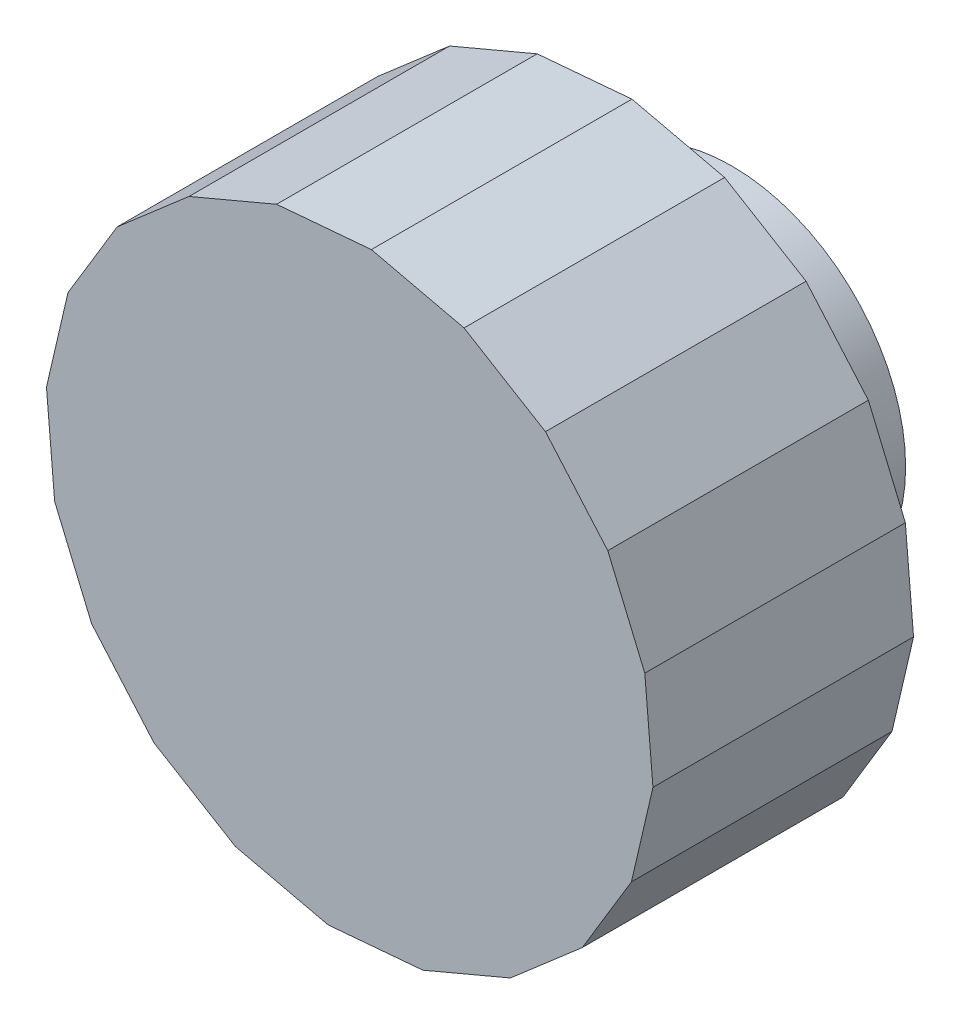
ISO-10303-21;
HEADER;
FILE_DESCRIPTION(('STEP AP214'),'2;1');
FILE_NAME('part.step','',(''),(''),'','','');
FILE_SCHEMA(('AUTOMOTIVE_DESIGN { 1 0 10303 214 1 1 1 1 }'));
ENDSEC;
DATA;
#1=APPLICATION_CONTEXT('core data for automotive mechanical design processes');
#2=APPLICATION_PROTOCOL_DEFINITION('international standard','automotive_design',2000,#1);
#3=PRODUCT_CONTEXT('',#1,'mechanical');
#4=PRODUCT('Part','Part','',(#3));
#5=PRODUCT_RELATED_PRODUCT_CATEGORY('part','',(#4));
#6=PRODUCT_DEFINITION_FORMATION('','',#4);
#7=PRODUCT_DEFINITION_CONTEXT('part definition',#1,'design');
#8=PRODUCT_DEFINITION('design','',#6,#7);
#9=PRODUCT_DEFINITION_SHAPE('','',#8);
#10=(LENGTH_UNIT() NAMED_UNIT(*) SI_UNIT(.MILLI.,.METRE.));
#11=(NAMED_UNIT(*) PLANE_ANGLE_UNIT() SI_UNIT($,.RADIAN.));
#12=(NAMED_UNIT(*) SI_UNIT($,.STERADIAN.) SOLID_ANGLE_UNIT());
#13=UNCERTAINTY_MEASURE_WITH_UNIT(LENGTH_MEASURE(1.E-05),#10,'distance_accuracy_value','');
#14=(GEOMETRIC_REPRESENTATION_CONTEXT(3) GLOBAL_UNCERTAINTY_ASSIGNED_CONTEXT((#13)) GLOBAL_UNIT_ASSIGNED_CONTEXT((#10,
#11,#12)) REPRESENTATION_CONTEXT('',''));
#15=CARTESIAN_POINT('',(0.,0.,0.));
#16=DIRECTION('',(0.,0.,1.));
#17=DIRECTION('',(1.,0.,0.));
#18=AXIS2_PLACEMENT_3D('',#15,#16,#17);
#19=CARTESIAN_POINT('',(0.,0.,7.));
#20=DIRECTION('',(0.,0.,-1.));
#21=DIRECTION('',(-1.,0.,0.));
#22=AXIS2_PLACEMENT_3D('',#19,#20,#21);
#23=CYLINDRICAL_SURFACE('',#22,10.);
#24=CARTESIAN_POINT('',(0.,10.,2.));
#25=CARTESIAN_POINT('',(0.083751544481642,9.99999865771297,2.00000345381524));
#26=CARTESIAN_POINT('',(0.167551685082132,9.9989368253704,2.00703800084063));
#27=CARTESIAN_POINT('',(0.332809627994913,9.99480315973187,2.03498319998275));
#28=CARTESIAN_POINT('',(0.414265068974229,9.99172936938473,2.05590736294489));
#29=CARTESIAN_POINT('',(0.57241808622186,9.98391721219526,2.11099250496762));
#30=CARTESIAN_POINT('',(0.649119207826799,9.97918010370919,2.14514347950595));
#31=CARTESIAN_POINT('',(0.795690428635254,9.96856475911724,2.22568837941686));
#32=CARTESIAN_POINT('',(0.865561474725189,9.96268668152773,2.27208060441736));
#33=CARTESIAN_POINT('',(0.997046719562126,9.95039170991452,2.37617726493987));
#34=CARTESIAN_POINT('',(1.0585998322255,9.94397133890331,2.43395845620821));
#35=CARTESIAN_POINT('',(1.17117490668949,9.93134261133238,2.55902768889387));
#36=CARTESIAN_POINT('',(1.22219626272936,9.92513426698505,2.62631627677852));
#37=CARTESIAN_POINT('',(1.31249729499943,9.91359877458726,2.76890064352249));
#38=CARTESIAN_POINT('',(1.35171787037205,9.90827611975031,2.84423424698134));
#39=CARTESIAN_POINT('',(1.41692632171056,9.89916211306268,3.00051282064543));
#40=CARTESIAN_POINT('',(1.44291491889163,9.89537067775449,3.08145748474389));
#41=CARTESIAN_POINT('',(1.48073198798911,9.88978256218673,3.24601804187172));
#42=CARTESIAN_POINT('',(1.49266503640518,9.8879711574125,3.32960939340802));
#43=CARTESIAN_POINT('',(1.50235624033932,9.88650348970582,3.49762616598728));
#44=CARTESIAN_POINT('',(1.50011520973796,9.88684710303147,3.58205153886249));
#45=CARTESIAN_POINT('',(1.48160733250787,9.88963718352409,3.74860108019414));
#46=CARTESIAN_POINT('',(1.4654569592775,9.89206618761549,3.8307385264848));
#47=CARTESIAN_POINT('',(1.41977117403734,9.89872608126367,3.99112436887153));
#48=CARTESIAN_POINT('',(1.39023538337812,9.90295702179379,4.06937265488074));
#49=CARTESIAN_POINT('',(1.31849603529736,9.91276335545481,4.22011337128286));
#50=CARTESIAN_POINT('',(1.27624314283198,9.91834396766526,4.29258196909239));
#51=CARTESIAN_POINT('',(1.18030413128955,9.93021707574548,4.42944459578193));
#52=CARTESIAN_POINT('',(1.12661726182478,9.93650961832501,4.49383809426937));
#53=CARTESIAN_POINT('',(1.00869493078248,9.94917473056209,4.61339766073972));
#54=CARTESIAN_POINT('',(0.944359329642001,9.95554747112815,4.66846499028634));
#55=CARTESIAN_POINT('',(0.807307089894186,9.96759647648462,4.76703593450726));
#56=CARTESIAN_POINT('',(0.73459041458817,9.9732727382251,4.8105394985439));
#57=CARTESIAN_POINT('',(0.582754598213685,9.98329515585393,4.88475308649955));
#58=CARTESIAN_POINT('',(0.50363167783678,9.98764051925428,4.9154554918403));
#59=CARTESIAN_POINT('',(0.34127318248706,9.99450490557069,4.96310938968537));
#60=CARTESIAN_POINT('',(0.2580378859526,9.99702405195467,4.98006181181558));
#61=CARTESIAN_POINT('',(0.0906695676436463,9.99993581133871,4.99960322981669));
#62=CARTESIAN_POINT('',(0.00655273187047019,10.0003485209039,5.00232797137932));
#63=CARTESIAN_POINT('',(-0.160936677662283,9.99905561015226,4.99369699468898));
#64=CARTESIAN_POINT('',(-0.244309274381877,9.99735005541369,4.9823417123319));
#65=CARTESIAN_POINT('',(-0.407532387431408,9.99202468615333,4.94598589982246));
#66=CARTESIAN_POINT('',(-0.487397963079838,9.98841415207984,4.92105150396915));
#67=CARTESIAN_POINT('',(-0.641814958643,9.97968235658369,4.85831500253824));
#68=CARTESIAN_POINT('',(-0.7163661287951,9.97456102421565,4.82051229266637));
#69=CARTESIAN_POINT('',(-0.858634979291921,9.96332682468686,4.73279377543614));
#70=CARTESIAN_POINT('',(-0.926299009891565,9.95720701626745,4.68279185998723));
#71=CARTESIAN_POINT('',(-1.05232367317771,9.94467863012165,4.57221418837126));
#72=CARTESIAN_POINT('',(-1.1106837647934,9.93827003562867,4.51163781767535));
#73=CARTESIAN_POINT('',(-1.21693784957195,9.92582264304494,4.38102646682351));
#74=CARTESIAN_POINT('',(-1.26474084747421,9.91978736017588,4.31091707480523));
#75=CARTESIAN_POINT('',(-1.34789129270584,9.90883219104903,4.16358395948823));
#76=CARTESIAN_POINT('',(-1.38323907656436,9.90391227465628,4.08636042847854));
#77=CARTESIAN_POINT('',(-1.44033467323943,9.89577033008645,3.92726246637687));
#78=CARTESIAN_POINT('',(-1.46213037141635,9.89254233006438,3.84540553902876));
#79=CARTESIAN_POINT('',(-1.49165549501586,9.88813382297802,3.67914098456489));
#80=CARTESIAN_POINT('',(-1.49938589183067,9.88695317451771,3.59473353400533));
#81=CARTESIAN_POINT('',(-1.5005378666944,9.88677832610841,3.42667093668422));
#82=CARTESIAN_POINT('',(-1.49410252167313,9.88776226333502,3.34301675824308));
#83=CARTESIAN_POINT('',(-1.46741229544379,9.89175820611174,3.17799473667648));
#84=CARTESIAN_POINT('',(-1.44715743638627,9.89477020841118,3.09662688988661));
#85=CARTESIAN_POINT('',(-1.39345373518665,9.90247526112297,2.93852691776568));
#86=CARTESIAN_POINT('',(-1.36001489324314,9.90716703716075,2.86179132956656));
#87=CARTESIAN_POINT('',(-1.28090667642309,9.91770454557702,2.7149963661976));
#88=CARTESIAN_POINT('',(-1.23523688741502,9.92355031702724,2.64493721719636));
#89=CARTESIAN_POINT('',(-1.13244337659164,9.93580743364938,2.51275694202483));
#90=CARTESIAN_POINT('',(-1.07521369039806,9.94222367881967,2.45071866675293));
#91=CARTESIAN_POINT('',(-0.951148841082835,9.95485788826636,2.33707544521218));
#92=CARTESIAN_POINT('',(-0.884311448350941,9.96107580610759,2.28547292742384));
#93=CARTESIAN_POINT('',(-0.742495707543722,9.9726518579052,2.19391232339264));
#94=CARTESIAN_POINT('',(-0.667474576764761,9.9780050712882,2.15401989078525));
#95=CARTESIAN_POINT('',(-0.511751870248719,9.98720028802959,2.08746148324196));
#96=CARTESIAN_POINT('',(-0.431056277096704,9.99104385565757,2.06078180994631));
#97=CARTESIAN_POINT('',(-0.291665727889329,9.99590939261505,2.02745865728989));
#98=CARTESIAN_POINT('',(-0.233831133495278,9.99743549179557,2.01717739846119));
#99=CARTESIAN_POINT('',(-0.117338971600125,9.99948125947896,2.00344690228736));
#100=CARTESIAN_POINT('',(-0.0586814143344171,10.0000009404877,1.99999758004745));
#101=CARTESIAN_POINT('',(0.,10.,2.));
#102=B_SPLINE_CURVE_WITH_KNOTS('',3,(#24,#25,#26,#27,#28,#29,#30,#31,#32,#33,#34,#35,#36,#37,
#38,#39,#40,#41,#42,#43,#44,#45,#46,#47,#48,#49,#50,#51,#52,#53,#54,#55,#56,#57,#58,#59,#60,#61,
#62,#63,#64,#65,#66,#67,#68,#69,#70,#71,#72,#73,#74,#75,#76,#77,#78,#79,#80,#81,#82,#83,#84,#85,
#86,#87,#88,#89,#90,#91,#92,#93,#94,#95,#96,#97,#98,#99,#100,#101),.UNSPECIFIED.,.T.,.F.,(4,2,2,
2,2,2,2,2,2,2,2,2,2,2,2,2,2,2,2,2,2,2,2,2,2,2,2,2,2,2,2,2,2,2,2,2,2,2,4),(0.,0.251040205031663,
0.50232496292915,0.753420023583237,1.0044802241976,1.25729416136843,1.5101226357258,
1.76419702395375,2.01825756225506,2.27041564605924,2.52255925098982,2.77261177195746,
3.02267136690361,3.27371383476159,3.52477278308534,3.77834291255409,4.03191415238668,
4.28563608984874,4.53934087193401,4.79062058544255,5.04189251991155,5.29195148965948,
5.54202220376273,5.79391188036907,6.0458162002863,6.29981366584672,6.55380426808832,
6.80689223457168,7.05996272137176,7.31048888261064,7.56101464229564,7.81135073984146,
8.06169531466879,8.3144482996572,8.56726003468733,8.82146323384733,9.07540233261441,
9.25129851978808,9.42719252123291),.UNSPECIFIED.);
#103=CARTESIAN_POINT('',(0.,10.,2.));
#104=VERTEX_POINT('',#103);
#105=EDGE_CURVE('E429',#104,#104,#102,.T.);
#106=ORIENTED_EDGE('',*,*,#105,.T.);
#107=EDGE_LOOP('',(#106));
#108=FACE_BOUND('',#107,.T.);
#109=CARTESIAN_POINT('',(0.,0.,7.));
#110=DIRECTION('',(0.,0.,1.));
#111=DIRECTION('',(1.,0.,0.));
#112=AXIS2_PLACEMENT_3D('',#109,#110,#111);
#113=CIRCLE('',#112,10.);
#114=CARTESIAN_POINT('',(10.,0.,7.));
#115=VERTEX_POINT('',#114);
#116=EDGE_CURVE('E11',#115,#115,#113,.T.);
#117=ORIENTED_EDGE('',*,*,#116,.F.);
#118=EDGE_LOOP('',(#117));
#119=FACE_BOUND('',#118,.T.);
#120=CARTESIAN_POINT('',(0.,0.,0.));
#121=DIRECTION('',(0.,0.,1.));
#122=DIRECTION('',(1.,0.,0.));
#123=AXIS2_PLACEMENT_3D('',#120,#121,#122);
#124=CIRCLE('',#123,10.);
#125=CARTESIAN_POINT('',(10.,0.,0.));
#126=VERTEX_POINT('',#125);
#127=EDGE_CURVE('E52',#126,#126,#124,.T.);
#128=ORIENTED_EDGE('',*,*,#127,.T.);
#129=EDGE_LOOP('',(#128));
#130=FACE_BOUND('',#129,.T.);
#131=ADVANCED_FACE('F43',(#108,#119,#130),#23,.T.);
#132=CARTESIAN_POINT('',(0.,0.,0.));
#133=DIRECTION('',(0.,0.,1.));
#134=DIRECTION('',(1.,0.,0.));
#135=AXIS2_PLACEMENT_3D('',#132,#133,#134);
#136=PLANE('',#135);
#137=DIRECTION('',(0.,1.,0.));
#138=VECTOR('',#137,1.);
#139=CARTESIAN_POINT('',(-2.75,0.,0.));
#140=LINE('',#139,#138);
#141=CARTESIAN_POINT('',(-2.75,5.5,0.));
#142=VERTEX_POINT('',#141);
#143=CARTESIAN_POINT('',(-2.75,8.5,0.));
#144=VERTEX_POINT('',#143);
#145=EDGE_CURVE('E486',#142,#144,#140,.T.);
#146=ORIENTED_EDGE('',*,*,#145,.F.);
#147=DIRECTION('',(-1.,0.,0.));
#148=VECTOR('',#147,1.);
#149=CARTESIAN_POINT('',(0.,5.5,0.));
#150=LINE('',#149,#148);
#151=CARTESIAN_POINT('',(2.75,5.5,0.));
#152=VERTEX_POINT('',#151);
#153=EDGE_CURVE('E60',#152,#142,#150,.T.);
#154=ORIENTED_EDGE('',*,*,#153,.F.);
#155=DIRECTION('',(0.,1.,0.));
#156=VECTOR('',#155,1.);
#157=CARTESIAN_POINT('',(2.75,0.,0.));
#158=LINE('',#157,#156);
#159=CARTESIAN_POINT('',(2.75,8.5,0.));
#160=VERTEX_POINT('',#159);
#161=EDGE_CURVE('E485',#152,#160,#158,.T.);
#162=ORIENTED_EDGE('',*,*,#161,.T.);
#163=DIRECTION('',(-1.,0.,0.));
#164=VECTOR('',#163,1.);
#165=CARTESIAN_POINT('',(0.,8.5,0.));
#166=LINE('',#165,#164);
#167=EDGE_CURVE('E474',#160,#144,#166,.T.);
#168=ORIENTED_EDGE('',*,*,#167,.T.);
#169=EDGE_LOOP('',(#146,#154,#162,#168));
#170=FACE_BOUND('',#169,.T.);
#171=CARTESIAN_POINT('',(0.,0.,0.));
#172=DIRECTION('',(0.,0.,-1.));
#173=DIRECTION('',(-1.,0.,0.));
#174=AXIS2_PLACEMENT_3D('',#171,#172,#173);
#175=CIRCLE('',#174,4.);
#176=CARTESIAN_POINT('',(-4.,0.,0.));
#177=VERTEX_POINT('',#176);
#178=EDGE_CURVE('E498',#177,#177,#175,.T.);
#179=ORIENTED_EDGE('',*,*,#178,.F.);
#180=EDGE_LOOP('',(#179));
#181=FACE_BOUND('',#180,.T.);
#182=ORIENTED_EDGE('',*,*,#127,.F.);
#183=EDGE_LOOP('',(#182));
#184=FACE_BOUND('',#183,.T.);
#185=ADVANCED_FACE('F321',(#170,#181,#184),#136,.F.);
#186=CARTESIAN_POINT('',(11.2687299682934,13.3890150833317,22.));
#187=DIRECTION('',(-0.516313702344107,-0.856399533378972,0.));
#188=DIRECTION('',(0.856399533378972,-0.516313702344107,0.));
#189=AXIS2_PLACEMENT_3D('',#186,#187,#188);
#190=PLANE('',#189);
#191=DIRECTION('',(-0.856399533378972,0.516313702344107,0.));
#192=VECTOR('',#191,1.);
#193=CARTESIAN_POINT('',(11.2687299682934,13.3890150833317,7.));
#194=LINE('',#193,#192);
#195=CARTESIAN_POINT('',(11.2687299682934,13.3890150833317,7.));
#196=VERTEX_POINT('',#195);
#197=CARTESIAN_POINT('',(6.57976586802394,16.2159391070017,7.));
#198=VERTEX_POINT('',#197);
#199=EDGE_CURVE('E227',#196,#198,#194,.T.);
#200=ORIENTED_EDGE('',*,*,#199,.T.);
#201=DIRECTION('',(0.,0.,-1.));
#202=VECTOR('',#201,1.);
#203=CARTESIAN_POINT('',(6.57976586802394,16.2159391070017,22.));
#204=LINE('',#203,#202);
#205=CARTESIAN_POINT('',(6.57976586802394,16.2159391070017,22.));
#206=VERTEX_POINT('',#205);
#207=EDGE_CURVE('E316',#206,#198,#204,.T.);
#208=ORIENTED_EDGE('',*,*,#207,.F.);
#209=DIRECTION('',(-0.856399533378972,0.516313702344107,0.));
#210=VECTOR('',#209,1.);
#211=CARTESIAN_POINT('',(11.2687299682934,13.3890150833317,22.));
#212=LINE('',#211,#210);
#213=CARTESIAN_POINT('',(11.2687299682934,13.3890150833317,22.));
#214=VERTEX_POINT('',#213);
#215=EDGE_CURVE('E267',#214,#206,#212,.T.);
#216=ORIENTED_EDGE('',*,*,#215,.F.);
#217=DIRECTION('',(0.,0.,-1.));
#218=VECTOR('',#217,1.);
#219=CARTESIAN_POINT('',(11.2687299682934,13.3890150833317,22.));
#220=LINE('',#219,#218);
#221=EDGE_CURVE('E223',#214,#196,#220,.T.);
#222=ORIENTED_EDGE('',*,*,#221,.T.);
#223=EDGE_LOOP('',(#200,#208,#216,#222));
#224=FACE_BOUND('',#223,.T.);
#225=ADVANCED_FACE('F323',(#224),#190,.F.);
#226=CARTESIAN_POINT('',(6.57976586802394,16.2159391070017,22.));
#227=DIRECTION('',(-0.226401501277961,-0.974034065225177,0.));
#228=DIRECTION('',(0.974034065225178,-0.226401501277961,0.));
#229=AXIS2_PLACEMENT_3D('',#226,#227,#228);
#230=PLANE('',#229);
#231=DIRECTION('',(-0.974034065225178,0.226401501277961,0.));
#232=VECTOR('',#231,1.);
#233=CARTESIAN_POINT('',(6.57976586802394,16.2159391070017,7.));
#234=LINE('',#233,#232);
#235=CARTESIAN_POINT('',(1.24672844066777,17.455534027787,7.));
#236=VERTEX_POINT('',#235);
#237=EDGE_CURVE('E230',#198,#236,#234,.T.);
#238=ORIENTED_EDGE('',*,*,#237,.T.);
#239=DIRECTION('',(0.,0.,-1.));
#240=VECTOR('',#239,1.);
#241=CARTESIAN_POINT('',(1.24672844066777,17.455534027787,22.));
#242=LINE('',#241,#240);
#243=CARTESIAN_POINT('',(1.24672844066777,17.455534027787,22.));
#244=VERTEX_POINT('',#243);
#245=EDGE_CURVE('E313',#244,#236,#242,.T.);
#246=ORIENTED_EDGE('',*,*,#245,.F.);
#247=DIRECTION('',(-0.974034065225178,0.226401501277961,0.));
#248=VECTOR('',#247,1.);
#249=CARTESIAN_POINT('',(6.57976586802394,16.2159391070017,22.));
#250=LINE('',#249,#248);
#251=EDGE_CURVE('E147',#206,#244,#250,.T.);
#252=ORIENTED_EDGE('',*,*,#251,.F.);
#253=ORIENTED_EDGE('',*,*,#207,.T.);
#254=EDGE_LOOP('',(#238,#246,#252,#253));
#255=FACE_BOUND('',#254,.T.);
#256=ADVANCED_FACE('F330',(#255),#230,.F.);
#257=CARTESIAN_POINT('',(1.24672844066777,17.455534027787,22.));
#258=DIRECTION('',(0.0856724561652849,-0.996323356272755,0.));
#259=DIRECTION('',(0.996323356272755,0.0856724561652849,0.));
#260=AXIS2_PLACEMENT_3D('',#257,#258,#259);
#261=PLANE('',#260);
#262=DIRECTION('',(-0.996323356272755,-0.0856724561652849,0.));
#263=VECTOR('',#262,1.);
#264=CARTESIAN_POINT('',(1.24672844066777,17.455534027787,7.));
#265=LINE('',#264,#263);
#266=CARTESIAN_POINT('',(-4.20834745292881,16.9864596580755,7.));
#267=VERTEX_POINT('',#266);
#268=EDGE_CURVE('E233',#236,#267,#265,.T.);
#269=ORIENTED_EDGE('',*,*,#268,.T.);
#270=DIRECTION('',(0.,0.,-1.));
#271=VECTOR('',#270,1.);
#272=CARTESIAN_POINT('',(-4.20834745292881,16.9864596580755,22.));
#273=LINE('',#272,#271);
#274=CARTESIAN_POINT('',(-4.20834745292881,16.9864596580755,22.));
#275=VERTEX_POINT('',#274);
#276=EDGE_CURVE('E310',#275,#267,#273,.T.);
#277=ORIENTED_EDGE('',*,*,#276,.F.);
#278=DIRECTION('',(-0.996323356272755,-0.0856724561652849,0.));
#279=VECTOR('',#278,1.);
#280=CARTESIAN_POINT('',(1.24672844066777,17.455534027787,22.));
#281=LINE('',#280,#279);
#282=EDGE_CURVE('E510',#244,#275,#281,.T.);
#283=ORIENTED_EDGE('',*,*,#282,.F.);
#284=ORIENTED_EDGE('',*,*,#245,.T.);
#285=EDGE_LOOP('',(#269,#277,#283,#284));
#286=FACE_BOUND('',#285,.T.);
#287=ADVANCED_FACE('F340',(#286),#261,.F.);
#288=CARTESIAN_POINT('',(-4.20834745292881,16.9864596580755,22.));
#289=DIRECTION('',(0.389360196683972,-0.921085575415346,0.));
#290=DIRECTION('',(0.921085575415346,0.389360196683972,0.));
#291=AXIS2_PLACEMENT_3D('',#288,#289,#290);
#292=PLANE('',#291);
#293=DIRECTION('',(-0.921085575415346,-0.389360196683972,0.));
#294=VECTOR('',#293,1.);
#295=CARTESIAN_POINT('',(-4.20834745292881,16.9864596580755,7.));
#296=LINE('',#295,#294);
#297=CARTESIAN_POINT('',(-9.25148097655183,14.854632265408,7.));
#298=VERTEX_POINT('',#297);
#299=EDGE_CURVE('E235',#267,#298,#296,.T.);
#300=ORIENTED_EDGE('',*,*,#299,.T.);
#301=DIRECTION('',(0.,0.,-1.));
#302=VECTOR('',#301,1.);
#303=CARTESIAN_POINT('',(-9.25148097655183,14.854632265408,22.));
#304=LINE('',#303,#302);
#305=CARTESIAN_POINT('',(-9.25148097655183,14.854632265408,22.));
#306=VERTEX_POINT('',#305);
#307=EDGE_CURVE('E307',#306,#298,#304,.T.);
#308=ORIENTED_EDGE('',*,*,#307,.F.);
#309=DIRECTION('',(-0.921085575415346,-0.389360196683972,0.));
#310=VECTOR('',#309,1.);
#311=CARTESIAN_POINT('',(-4.20834745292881,16.9864596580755,22.));
#312=LINE('',#311,#310);
#313=EDGE_CURVE('E512',#275,#306,#312,.T.);
#314=ORIENTED_EDGE('',*,*,#313,.F.);
#315=ORIENTED_EDGE('',*,*,#276,.T.);
#316=EDGE_LOOP('',(#300,#308,#314,#315));
#317=FACE_BOUND('',#316,.T.);
#318=ADVANCED_FACE('F343',(#317),#292,.F.);
#319=CARTESIAN_POINT('',(-9.25148097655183,14.854632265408,22.));
#320=DIRECTION('',(0.654934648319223,-0.755685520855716,0.));
#321=DIRECTION('',(0.755685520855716,0.654934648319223,0.));
#322=AXIS2_PLACEMENT_3D('',#319,#320,#321);
#323=PLANE('',#322);
#324=DIRECTION('',(-0.755685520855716,-0.654934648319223,0.));
#325=VECTOR('',#324,1.);
#326=CARTESIAN_POINT('',(-9.25148097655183,14.854632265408,7.));
#327=LINE('',#326,#325);
#328=CARTESIAN_POINT('',(-13.3890150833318,11.2687299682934,7.));
#329=VERTEX_POINT('',#328);
#330=EDGE_CURVE('E237',#298,#329,#327,.T.);
#331=ORIENTED_EDGE('',*,*,#330,.T.);
#332=DIRECTION('',(0.,0.,-1.));
#333=VECTOR('',#332,1.);
#334=CARTESIAN_POINT('',(-13.3890150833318,11.2687299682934,22.));
#335=LINE('',#334,#333);
#336=CARTESIAN_POINT('',(-13.3890150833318,11.2687299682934,22.));
#337=VERTEX_POINT('',#336);
#338=EDGE_CURVE('E304',#337,#329,#335,.T.);
#339=ORIENTED_EDGE('',*,*,#338,.F.);
#340=DIRECTION('',(-0.755685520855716,-0.654934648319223,0.));
#341=VECTOR('',#340,1.);
#342=CARTESIAN_POINT('',(-9.25148097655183,14.854632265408,22.));
#343=LINE('',#342,#341);
#344=EDGE_CURVE('E514',#306,#337,#343,.T.);
#345=ORIENTED_EDGE('',*,*,#344,.F.);
#346=ORIENTED_EDGE('',*,*,#307,.T.);
#347=EDGE_LOOP('',(#331,#339,#345,#346));
#348=FACE_BOUND('',#347,.T.);
#349=ADVANCED_FACE('F347',(#348),#323,.F.);
#350=CARTESIAN_POINT('',(-13.3890150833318,11.2687299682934,22.));
#351=DIRECTION('',(0.856399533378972,-0.516313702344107,0.));
#352=DIRECTION('',(0.516313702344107,0.856399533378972,0.));
#353=AXIS2_PLACEMENT_3D('',#350,#351,#352);
#354=PLANE('',#353);
#355=DIRECTION('',(-0.516313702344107,-0.856399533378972,0.));
#356=VECTOR('',#355,1.);
#357=CARTESIAN_POINT('',(-13.3890150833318,11.2687299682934,7.));
#358=LINE('',#357,#356);
#359=CARTESIAN_POINT('',(-16.2159391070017,6.57976586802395,7.));
#360=VERTEX_POINT('',#359);
#361=EDGE_CURVE('E239',#329,#360,#358,.T.);
#362=ORIENTED_EDGE('',*,*,#361,.T.);
#363=DIRECTION('',(0.,0.,-1.));
#364=VECTOR('',#363,1.);
#365=CARTESIAN_POINT('',(-16.2159391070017,6.57976586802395,22.));
#366=LINE('',#365,#364);
#367=CARTESIAN_POINT('',(-16.2159391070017,6.57976586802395,22.));
#368=VERTEX_POINT('',#367);
#369=EDGE_CURVE('E301',#368,#360,#366,.T.);
#370=ORIENTED_EDGE('',*,*,#369,.F.);
#371=DIRECTION('',(-0.516313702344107,-0.856399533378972,0.));
#372=VECTOR('',#371,1.);
#373=CARTESIAN_POINT('',(-13.3890150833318,11.2687299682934,22.));
#374=LINE('',#373,#372);
#375=EDGE_CURVE('E516',#337,#368,#374,.T.);
#376=ORIENTED_EDGE('',*,*,#375,.F.);
#377=ORIENTED_EDGE('',*,*,#338,.T.);
#378=EDGE_LOOP('',(#362,#370,#376,#377));
#379=FACE_BOUND('',#378,.T.);
#380=ADVANCED_FACE('F351',(#379),#354,.F.);
#381=CARTESIAN_POINT('',(-16.2159391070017,6.57976586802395,22.));
#382=DIRECTION('',(0.974034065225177,-0.226401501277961,0.));
#383=DIRECTION('',(0.226401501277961,0.974034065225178,0.));
#384=AXIS2_PLACEMENT_3D('',#381,#382,#383);
#385=PLANE('',#384);
#386=DIRECTION('',(-0.226401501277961,-0.974034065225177,0.));
#387=VECTOR('',#386,1.);
#388=CARTESIAN_POINT('',(-16.2159391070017,6.57976586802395,7.));
#389=LINE('',#388,#387);
#390=CARTESIAN_POINT('',(-17.455534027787,1.24672844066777,7.));
#391=VERTEX_POINT('',#390);
#392=EDGE_CURVE('E241',#360,#391,#389,.T.);
#393=ORIENTED_EDGE('',*,*,#392,.T.);
#394=DIRECTION('',(0.,0.,-1.));
#395=VECTOR('',#394,1.);
#396=CARTESIAN_POINT('',(-17.455534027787,1.24672844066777,22.));
#397=LINE('',#396,#395);
#398=CARTESIAN_POINT('',(-17.455534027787,1.24672844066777,22.));
#399=VERTEX_POINT('',#398);
#400=EDGE_CURVE('E298',#399,#391,#397,.T.);
#401=ORIENTED_EDGE('',*,*,#400,.F.);
#402=DIRECTION('',(-0.226401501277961,-0.974034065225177,0.));
#403=VECTOR('',#402,1.);
#404=CARTESIAN_POINT('',(-16.2159391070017,6.57976586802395,22.));
#405=LINE('',#404,#403);
#406=EDGE_CURVE('E518',#368,#399,#405,.T.);
#407=ORIENTED_EDGE('',*,*,#406,.F.);
#408=ORIENTED_EDGE('',*,*,#369,.T.);
#409=EDGE_LOOP('',(#393,#401,#407,#408));
#410=FACE_BOUND('',#409,.T.);
#411=ADVANCED_FACE('F355',(#410),#385,.F.);
#412=CARTESIAN_POINT('',(-17.455534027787,1.24672844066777,22.));
#413=DIRECTION('',(0.996323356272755,0.0856724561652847,0.));
#414=DIRECTION('',(-0.0856724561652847,0.996323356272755,0.));
#415=AXIS2_PLACEMENT_3D('',#412,#413,#414);
#416=PLANE('',#415);
#417=DIRECTION('',(0.0856724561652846,-0.996323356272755,0.));
#418=VECTOR('',#417,1.);
#419=CARTESIAN_POINT('',(-17.455534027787,1.24672844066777,7.));
#420=LINE('',#419,#418);
#421=CARTESIAN_POINT('',(-16.9864596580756,-4.20834745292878,7.));
#422=VERTEX_POINT('',#421);
#423=EDGE_CURVE('E243',#391,#422,#420,.T.);
#424=ORIENTED_EDGE('',*,*,#423,.T.);
#425=DIRECTION('',(0.,0.,-1.));
#426=VECTOR('',#425,1.);
#427=CARTESIAN_POINT('',(-16.9864596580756,-4.20834745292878,22.));
#428=LINE('',#427,#426);
#429=CARTESIAN_POINT('',(-16.9864596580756,-4.20834745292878,22.));
#430=VERTEX_POINT('',#429);
#431=EDGE_CURVE('E295',#430,#422,#428,.T.);
#432=ORIENTED_EDGE('',*,*,#431,.F.);
#433=DIRECTION('',(0.0856724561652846,-0.996323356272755,0.));
#434=VECTOR('',#433,1.);
#435=CARTESIAN_POINT('',(-17.455534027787,1.24672844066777,22.));
#436=LINE('',#435,#434);
#437=EDGE_CURVE('E520',#399,#430,#436,.T.);
#438=ORIENTED_EDGE('',*,*,#437,.F.);
#439=ORIENTED_EDGE('',*,*,#400,.T.);
#440=EDGE_LOOP('',(#424,#432,#438,#439));
#441=FACE_BOUND('',#440,.T.);
#442=ADVANCED_FACE('F359',(#441),#416,.F.);
#443=CARTESIAN_POINT('',(-16.9864596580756,-4.20834745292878,22.));
#444=DIRECTION('',(0.921085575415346,0.389360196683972,0.));
#445=DIRECTION('',(-0.389360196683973,0.921085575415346,0.));
#446=AXIS2_PLACEMENT_3D('',#443,#444,#445);
#447=PLANE('',#446);
#448=DIRECTION('',(0.389360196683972,-0.921085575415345,0.));
#449=VECTOR('',#448,1.);
#450=CARTESIAN_POINT('',(-16.9864596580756,-4.20834745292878,7.));
#451=LINE('',#450,#449);
#452=CARTESIAN_POINT('',(-14.854632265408,-9.25148097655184,7.));
#453=VERTEX_POINT('',#452);
#454=EDGE_CURVE('E245',#422,#453,#451,.T.);
#455=ORIENTED_EDGE('',*,*,#454,.T.);
#456=DIRECTION('',(0.,0.,-1.));
#457=VECTOR('',#456,1.);
#458=CARTESIAN_POINT('',(-14.854632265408,-9.25148097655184,22.));
#459=LINE('',#458,#457);
#460=CARTESIAN_POINT('',(-14.854632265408,-9.25148097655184,22.));
#461=VERTEX_POINT('',#460);
#462=EDGE_CURVE('E292',#461,#453,#459,.T.);
#463=ORIENTED_EDGE('',*,*,#462,.F.);
#464=DIRECTION('',(0.389360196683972,-0.921085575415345,0.));
#465=VECTOR('',#464,1.);
#466=CARTESIAN_POINT('',(-16.9864596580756,-4.20834745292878,22.));
#467=LINE('',#466,#465);
#468=EDGE_CURVE('E522',#430,#461,#467,.T.);
#469=ORIENTED_EDGE('',*,*,#468,.F.);
#470=ORIENTED_EDGE('',*,*,#431,.T.);
#471=EDGE_LOOP('',(#455,#463,#469,#470));
#472=FACE_BOUND('',#471,.T.);
#473=ADVANCED_FACE('F363',(#472),#447,.F.);
#474=CARTESIAN_POINT('',(-14.854632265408,-9.25148097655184,22.));
#475=DIRECTION('',(0.755685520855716,0.654934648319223,0.));
#476=DIRECTION('',(-0.654934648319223,0.755685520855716,0.));
#477=AXIS2_PLACEMENT_3D('',#474,#475,#476);
#478=PLANE('',#477);
#479=DIRECTION('',(0.654934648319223,-0.755685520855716,0.));
#480=VECTOR('',#479,1.);
#481=CARTESIAN_POINT('',(-14.854632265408,-9.25148097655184,7.));
#482=LINE('',#481,#480);
#483=CARTESIAN_POINT('',(-11.2687299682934,-13.3890150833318,7.));
#484=VERTEX_POINT('',#483);
#485=EDGE_CURVE('E247',#453,#484,#482,.T.);
#486=ORIENTED_EDGE('',*,*,#485,.T.);
#487=DIRECTION('',(0.,0.,-1.));
#488=VECTOR('',#487,1.);
#489=CARTESIAN_POINT('',(-11.2687299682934,-13.3890150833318,22.));
#490=LINE('',#489,#488);
#491=CARTESIAN_POINT('',(-11.2687299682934,-13.3890150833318,22.));
#492=VERTEX_POINT('',#491);
#493=EDGE_CURVE('E289',#492,#484,#490,.T.);
#494=ORIENTED_EDGE('',*,*,#493,.F.);
#495=DIRECTION('',(0.654934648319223,-0.755685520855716,0.));
#496=VECTOR('',#495,1.);
#497=CARTESIAN_POINT('',(-14.854632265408,-9.25148097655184,22.));
#498=LINE('',#497,#496);
#499=EDGE_CURVE('E524',#461,#492,#498,.T.);
#500=ORIENTED_EDGE('',*,*,#499,.F.);
#501=ORIENTED_EDGE('',*,*,#462,.T.);
#502=EDGE_LOOP('',(#486,#494,#500,#501));
#503=FACE_BOUND('',#502,.T.);
#504=ADVANCED_FACE('F367',(#503),#478,.F.);
#505=CARTESIAN_POINT('',(-11.2687299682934,-13.3890150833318,22.));
#506=DIRECTION('',(0.516313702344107,0.856399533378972,0.));
#507=DIRECTION('',(-0.856399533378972,0.516313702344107,0.));
#508=AXIS2_PLACEMENT_3D('',#505,#506,#507);
#509=PLANE('',#508);
#510=DIRECTION('',(0.856399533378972,-0.516313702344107,0.));
#511=VECTOR('',#510,1.);
#512=CARTESIAN_POINT('',(-11.2687299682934,-13.3890150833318,7.));
#513=LINE('',#512,#511);
#514=CARTESIAN_POINT('',(-6.57976586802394,-16.2159391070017,7.));
#515=VERTEX_POINT('',#514);
#516=EDGE_CURVE('E249',#484,#515,#513,.T.);
#517=ORIENTED_EDGE('',*,*,#516,.T.);
#518=DIRECTION('',(0.,0.,-1.));
#519=VECTOR('',#518,1.);
#520=CARTESIAN_POINT('',(-6.57976586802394,-16.2159391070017,22.));
#521=LINE('',#520,#519);
#522=CARTESIAN_POINT('',(-6.57976586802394,-16.2159391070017,22.));
#523=VERTEX_POINT('',#522);
#524=EDGE_CURVE('E286',#523,#515,#521,.T.);
#525=ORIENTED_EDGE('',*,*,#524,.F.);
#526=DIRECTION('',(0.856399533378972,-0.516313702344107,0.));
#527=VECTOR('',#526,1.);
#528=CARTESIAN_POINT('',(-11.2687299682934,-13.3890150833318,22.));
#529=LINE('',#528,#527);
#530=EDGE_CURVE('E526',#492,#523,#529,.T.);
#531=ORIENTED_EDGE('',*,*,#530,.F.);
#532=ORIENTED_EDGE('',*,*,#493,.T.);
#533=EDGE_LOOP('',(#517,#525,#531,#532));
#534=FACE_BOUND('',#533,.T.);
#535=ADVANCED_FACE('F371',(#534),#509,.F.);
#536=CARTESIAN_POINT('',(-6.57976586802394,-16.2159391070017,22.));
#537=DIRECTION('',(0.226401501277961,0.974034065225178,0.));
#538=DIRECTION('',(-0.974034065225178,0.226401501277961,0.));
#539=AXIS2_PLACEMENT_3D('',#536,#537,#538);
#540=PLANE('',#539);
#541=DIRECTION('',(0.974034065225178,-0.226401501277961,0.));
#542=VECTOR('',#541,1.);
#543=CARTESIAN_POINT('',(-6.57976586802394,-16.2159391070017,7.));
#544=LINE('',#543,#542);
#545=CARTESIAN_POINT('',(-1.2467284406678,-17.455534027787,7.));
#546=VERTEX_POINT('',#545);
#547=EDGE_CURVE('E251',#515,#546,#544,.T.);
#548=ORIENTED_EDGE('',*,*,#547,.T.);
#549=DIRECTION('',(0.,0.,-1.));
#550=VECTOR('',#549,1.);
#551=CARTESIAN_POINT('',(-1.2467284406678,-17.455534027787,22.));
#552=LINE('',#551,#550);
#553=CARTESIAN_POINT('',(-1.2467284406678,-17.455534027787,22.));
#554=VERTEX_POINT('',#553);
#555=EDGE_CURVE('E283',#554,#546,#552,.T.);
#556=ORIENTED_EDGE('',*,*,#555,.F.);
#557=DIRECTION('',(0.974034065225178,-0.226401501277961,0.));
#558=VECTOR('',#557,1.);
#559=CARTESIAN_POINT('',(-6.57976586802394,-16.2159391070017,22.));
#560=LINE('',#559,#558);
#561=EDGE_CURVE('E528',#523,#554,#560,.T.);
#562=ORIENTED_EDGE('',*,*,#561,.F.);
#563=ORIENTED_EDGE('',*,*,#524,.T.);
#564=EDGE_LOOP('',(#548,#556,#562,#563));
#565=FACE_BOUND('',#564,.T.);
#566=ADVANCED_FACE('F375',(#565),#540,.F.);
#567=CARTESIAN_POINT('',(-1.2467284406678,-17.455534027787,22.));
#568=DIRECTION('',(-0.0856724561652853,0.996323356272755,0.));
#569=DIRECTION('',(-0.996323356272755,-0.0856724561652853,0.));
#570=AXIS2_PLACEMENT_3D('',#567,#568,#569);
#571=PLANE('',#570);
#572=DIRECTION('',(0.996323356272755,0.0856724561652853,0.));
#573=VECTOR('',#572,1.);
#574=CARTESIAN_POINT('',(-1.2467284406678,-17.455534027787,7.));
#575=LINE('',#574,#573);
#576=CARTESIAN_POINT('',(4.20834745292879,-16.9864596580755,7.));
#577=VERTEX_POINT('',#576);
#578=EDGE_CURVE('E253',#546,#577,#575,.T.);
#579=ORIENTED_EDGE('',*,*,#578,.T.);
#580=DIRECTION('',(0.,0.,-1.));
#581=VECTOR('',#580,1.);
#582=CARTESIAN_POINT('',(4.20834745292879,-16.9864596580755,22.));
#583=LINE('',#582,#581);
#584=CARTESIAN_POINT('',(4.20834745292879,-16.9864596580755,22.));
#585=VERTEX_POINT('',#584);
#586=EDGE_CURVE('E280',#585,#577,#583,.T.);
#587=ORIENTED_EDGE('',*,*,#586,.F.);
#588=DIRECTION('',(0.996323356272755,0.0856724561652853,0.));
#589=VECTOR('',#588,1.);
#590=CARTESIAN_POINT('',(-1.2467284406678,-17.455534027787,22.));
#591=LINE('',#590,#589);
#592=EDGE_CURVE('E530',#554,#585,#591,.T.);
#593=ORIENTED_EDGE('',*,*,#592,.F.);
#594=ORIENTED_EDGE('',*,*,#555,.T.);
#595=EDGE_LOOP('',(#579,#587,#593,#594));
#596=FACE_BOUND('',#595,.T.);
#597=ADVANCED_FACE('F379',(#596),#571,.F.);
#598=CARTESIAN_POINT('',(4.20834745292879,-16.9864596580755,22.));
#599=DIRECTION('',(-0.389360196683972,0.921085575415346,0.));
#600=DIRECTION('',(-0.921085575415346,-0.389360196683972,0.));
#601=AXIS2_PLACEMENT_3D('',#598,#599,#600);
#602=PLANE('',#601);
#603=DIRECTION('',(0.921085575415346,0.389360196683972,0.));
#604=VECTOR('',#603,1.);
#605=CARTESIAN_POINT('',(4.20834745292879,-16.9864596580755,7.));
#606=LINE('',#605,#604);
#607=CARTESIAN_POINT('',(9.25148097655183,-14.854632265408,7.));
#608=VERTEX_POINT('',#607);
#609=EDGE_CURVE('E255',#577,#608,#606,.T.);
#610=ORIENTED_EDGE('',*,*,#609,.T.);
#611=DIRECTION('',(0.,0.,-1.));
#612=VECTOR('',#611,1.);
#613=CARTESIAN_POINT('',(9.25148097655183,-14.854632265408,22.));
#614=LINE('',#613,#612);
#615=CARTESIAN_POINT('',(9.25148097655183,-14.854632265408,22.));
#616=VERTEX_POINT('',#615);
#617=EDGE_CURVE('E277',#616,#608,#614,.T.);
#618=ORIENTED_EDGE('',*,*,#617,.F.);
#619=DIRECTION('',(0.921085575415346,0.389360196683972,0.));
#620=VECTOR('',#619,1.);
#621=CARTESIAN_POINT('',(4.20834745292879,-16.9864596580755,22.));
#622=LINE('',#621,#620);
#623=EDGE_CURVE('E532',#585,#616,#622,.T.);
#624=ORIENTED_EDGE('',*,*,#623,.F.);
#625=ORIENTED_EDGE('',*,*,#586,.T.);
#626=EDGE_LOOP('',(#610,#618,#624,#625));
#627=FACE_BOUND('',#626,.T.);
#628=ADVANCED_FACE('F383',(#627),#602,.F.);
#629=CARTESIAN_POINT('',(9.25148097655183,-14.854632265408,22.));
#630=DIRECTION('',(-0.654934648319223,0.755685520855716,0.));
#631=DIRECTION('',(-0.755685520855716,-0.654934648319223,0.));
#632=AXIS2_PLACEMENT_3D('',#629,#630,#631);
#633=PLANE('',#632);
#634=DIRECTION('',(0.755685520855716,0.654934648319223,0.));
#635=VECTOR('',#634,1.);
#636=CARTESIAN_POINT('',(9.25148097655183,-14.854632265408,7.));
#637=LINE('',#636,#635);
#638=CARTESIAN_POINT('',(13.3890150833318,-11.2687299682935,7.));
#639=VERTEX_POINT('',#638);
#640=EDGE_CURVE('E257',#608,#639,#637,.T.);
#641=ORIENTED_EDGE('',*,*,#640,.T.);
#642=DIRECTION('',(0.,0.,-1.));
#643=VECTOR('',#642,1.);
#644=CARTESIAN_POINT('',(13.3890150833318,-11.2687299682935,22.));
#645=LINE('',#644,#643);
#646=CARTESIAN_POINT('',(13.3890150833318,-11.2687299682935,22.));
#647=VERTEX_POINT('',#646);
#648=EDGE_CURVE('E274',#647,#639,#645,.T.);
#649=ORIENTED_EDGE('',*,*,#648,.F.);
#650=DIRECTION('',(0.755685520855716,0.654934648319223,0.));
#651=VECTOR('',#650,1.);
#652=CARTESIAN_POINT('',(9.25148097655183,-14.854632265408,22.));
#653=LINE('',#652,#651);
#654=EDGE_CURVE('E534',#616,#647,#653,.T.);
#655=ORIENTED_EDGE('',*,*,#654,.F.);
#656=ORIENTED_EDGE('',*,*,#617,.T.);
#657=EDGE_LOOP('',(#641,#649,#655,#656));
#658=FACE_BOUND('',#657,.T.);
#659=ADVANCED_FACE('F387',(#658),#633,.F.);
#660=CARTESIAN_POINT('',(13.3890150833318,-11.2687299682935,22.));
#661=DIRECTION('',(-0.856399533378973,0.516313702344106,0.));
#662=DIRECTION('',(-0.516313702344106,-0.856399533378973,0.));
#663=AXIS2_PLACEMENT_3D('',#660,#661,#662);
#664=PLANE('',#663);
#665=DIRECTION('',(0.516313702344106,0.856399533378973,0.));
#666=VECTOR('',#665,1.);
#667=CARTESIAN_POINT('',(13.3890150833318,-11.2687299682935,7.));
#668=LINE('',#667,#666);
#669=CARTESIAN_POINT('',(16.2159391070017,-6.57976586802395,7.));
#670=VERTEX_POINT('',#669);
#671=EDGE_CURVE('E259',#639,#670,#668,.T.);
#672=ORIENTED_EDGE('',*,*,#671,.T.);
#673=DIRECTION('',(0.,0.,-1.));
#674=VECTOR('',#673,1.);
#675=CARTESIAN_POINT('',(16.2159391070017,-6.57976586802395,22.));
#676=LINE('',#675,#674);
#677=CARTESIAN_POINT('',(16.2159391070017,-6.57976586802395,22.));
#678=VERTEX_POINT('',#677);
#679=EDGE_CURVE('E271',#678,#670,#676,.T.);
#680=ORIENTED_EDGE('',*,*,#679,.F.);
#681=DIRECTION('',(0.516313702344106,0.856399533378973,0.));
#682=VECTOR('',#681,1.);
#683=CARTESIAN_POINT('',(13.3890150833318,-11.2687299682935,22.));
#684=LINE('',#683,#682);
#685=EDGE_CURVE('E536',#647,#678,#684,.T.);
#686=ORIENTED_EDGE('',*,*,#685,.F.);
#687=ORIENTED_EDGE('',*,*,#648,.T.);
#688=EDGE_LOOP('',(#672,#680,#686,#687));
#689=FACE_BOUND('',#688,.T.);
#690=ADVANCED_FACE('F391',(#689),#664,.F.);
#691=CARTESIAN_POINT('',(16.2159391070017,-6.57976586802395,22.));
#692=DIRECTION('',(-0.974034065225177,0.226401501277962,0.));
#693=DIRECTION('',(-0.226401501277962,-0.974034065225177,0.));
#694=AXIS2_PLACEMENT_3D('',#691,#692,#693);
#695=PLANE('',#694);
#696=DIRECTION('',(0.226401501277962,0.974034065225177,0.));
#697=VECTOR('',#696,1.);
#698=CARTESIAN_POINT('',(16.2159391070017,-6.57976586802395,7.));
#699=LINE('',#698,#697);
#700=CARTESIAN_POINT('',(17.455534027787,-1.24672844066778,7.));
#701=VERTEX_POINT('',#700);
#702=EDGE_CURVE('E261',#670,#701,#699,.T.);
#703=ORIENTED_EDGE('',*,*,#702,.T.);
#704=DIRECTION('',(0.,0.,-1.));
#705=VECTOR('',#704,1.);
#706=CARTESIAN_POINT('',(17.455534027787,-1.24672844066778,22.));
#707=LINE('',#706,#705);
#708=CARTESIAN_POINT('',(17.455534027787,-1.24672844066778,22.));
#709=VERTEX_POINT('',#708);
#710=EDGE_CURVE('E218',#709,#701,#707,.T.);
#711=ORIENTED_EDGE('',*,*,#710,.F.);
#712=DIRECTION('',(0.226401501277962,0.974034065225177,0.));
#713=VECTOR('',#712,1.);
#714=CARTESIAN_POINT('',(16.2159391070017,-6.57976586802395,22.));
#715=LINE('',#714,#713);
#716=EDGE_CURVE('E206',#678,#709,#715,.T.);
#717=ORIENTED_EDGE('',*,*,#716,.F.);
#718=ORIENTED_EDGE('',*,*,#679,.T.);
#719=EDGE_LOOP('',(#703,#711,#717,#718));
#720=FACE_BOUND('',#719,.T.);
#721=ADVANCED_FACE('F395',(#720),#695,.F.);
#722=CARTESIAN_POINT('',(17.455534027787,-1.24672844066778,22.));
#723=DIRECTION('',(-0.996323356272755,-0.0856724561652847,0.));
#724=DIRECTION('',(0.0856724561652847,-0.996323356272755,0.));
#725=AXIS2_PLACEMENT_3D('',#722,#723,#724);
#726=PLANE('',#725);
#727=DIRECTION('',(-0.0856724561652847,0.996323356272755,0.));
#728=VECTOR('',#727,1.);
#729=CARTESIAN_POINT('',(17.455534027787,-1.24672844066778,7.));
#730=LINE('',#729,#728);
#731=CARTESIAN_POINT('',(16.9864596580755,4.20834745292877,7.));
#732=VERTEX_POINT('',#731);
#733=EDGE_CURVE('E215',#701,#732,#730,.T.);
#734=ORIENTED_EDGE('',*,*,#733,.T.);
#735=DIRECTION('',(0.,0.,-1.));
#736=VECTOR('',#735,1.);
#737=CARTESIAN_POINT('',(16.9864596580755,4.20834745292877,22.));
#738=LINE('',#737,#736);
#739=CARTESIAN_POINT('',(16.9864596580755,4.20834745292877,22.));
#740=VERTEX_POINT('',#739);
#741=EDGE_CURVE('E212',#740,#732,#738,.T.);
#742=ORIENTED_EDGE('',*,*,#741,.F.);
#743=DIRECTION('',(-0.0856724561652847,0.996323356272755,0.));
#744=VECTOR('',#743,1.);
#745=CARTESIAN_POINT('',(17.455534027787,-1.24672844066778,22.));
#746=LINE('',#745,#744);
#747=EDGE_CURVE('E199',#709,#740,#746,.T.);
#748=ORIENTED_EDGE('',*,*,#747,.F.);
#749=ORIENTED_EDGE('',*,*,#710,.T.);
#750=EDGE_LOOP('',(#734,#742,#748,#749));
#751=FACE_BOUND('',#750,.T.);
#752=ADVANCED_FACE('F213',(#751),#726,.F.);
#753=CARTESIAN_POINT('',(16.9864596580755,4.20834745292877,22.));
#754=DIRECTION('',(-0.921085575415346,-0.389360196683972,0.));
#755=DIRECTION('',(0.389360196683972,-0.921085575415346,0.));
#756=AXIS2_PLACEMENT_3D('',#753,#754,#755);
#757=PLANE('',#756);
#758=DIRECTION('',(-0.389360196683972,0.921085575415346,0.));
#759=VECTOR('',#758,1.);
#760=CARTESIAN_POINT('',(16.9864596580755,4.20834745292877,7.));
#761=LINE('',#760,#759);
#762=CARTESIAN_POINT('',(14.854632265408,9.25148097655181,7.));
#763=VERTEX_POINT('',#762);
#764=EDGE_CURVE('E264',#732,#763,#761,.T.);
#765=ORIENTED_EDGE('',*,*,#764,.T.);
#766=DIRECTION('',(0.,0.,-1.));
#767=VECTOR('',#766,1.);
#768=CARTESIAN_POINT('',(14.854632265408,9.25148097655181,22.));
#769=LINE('',#768,#767);
#770=CARTESIAN_POINT('',(14.854632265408,9.25148097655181,22.));
#771=VERTEX_POINT('',#770);
#772=EDGE_CURVE('E219',#771,#763,#769,.T.);
#773=ORIENTED_EDGE('',*,*,#772,.F.);
#774=DIRECTION('',(-0.389360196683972,0.921085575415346,0.));
#775=VECTOR('',#774,1.);
#776=CARTESIAN_POINT('',(16.9864596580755,4.20834745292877,22.));
#777=LINE('',#776,#775);
#778=EDGE_CURVE('E203',#740,#771,#777,.T.);
#779=ORIENTED_EDGE('',*,*,#778,.F.);
#780=ORIENTED_EDGE('',*,*,#741,.T.);
#781=EDGE_LOOP('',(#765,#773,#779,#780));
#782=FACE_BOUND('',#781,.T.);
#783=ADVANCED_FACE('F221',(#782),#757,.F.);
#784=CARTESIAN_POINT('',(14.854632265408,9.25148097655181,22.));
#785=DIRECTION('',(-0.755685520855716,-0.654934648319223,0.));
#786=DIRECTION('',(0.654934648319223,-0.755685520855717,0.));
#787=AXIS2_PLACEMENT_3D('',#784,#785,#786);
#788=PLANE('',#787);
#789=DIRECTION('',(-0.654934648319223,0.755685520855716,0.));
#790=VECTOR('',#789,1.);
#791=CARTESIAN_POINT('',(14.854632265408,9.25148097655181,7.));
#792=LINE('',#791,#790);
#793=EDGE_CURVE('E138',#763,#196,#792,.T.);
#794=ORIENTED_EDGE('',*,*,#793,.T.);
#795=ORIENTED_EDGE('',*,*,#221,.F.);
#796=DIRECTION('',(-0.654934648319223,0.755685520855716,0.));
#797=VECTOR('',#796,1.);
#798=CARTESIAN_POINT('',(14.854632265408,9.25148097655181,22.));
#799=LINE('',#798,#797);
#800=EDGE_CURVE('E69',#771,#214,#799,.T.);
#801=ORIENTED_EDGE('',*,*,#800,.F.);
#802=ORIENTED_EDGE('',*,*,#772,.T.);
#803=EDGE_LOOP('',(#794,#795,#801,#802));
#804=FACE_BOUND('',#803,.T.);
#805=ADVANCED_FACE('F404',(#804),#788,.F.);
#806=CARTESIAN_POINT('',(0.,0.,22.));
#807=DIRECTION('',(0.,0.,1.));
#808=DIRECTION('',(1.,0.,0.));
#809=AXIS2_PLACEMENT_3D('',#806,#807,#808);
#810=PLANE('',#809);
#811=ORIENTED_EDGE('',*,*,#215,.T.);
#812=ORIENTED_EDGE('',*,*,#251,.T.);
#813=ORIENTED_EDGE('',*,*,#282,.T.);
#814=ORIENTED_EDGE('',*,*,#313,.T.);
#815=ORIENTED_EDGE('',*,*,#344,.T.);
#816=ORIENTED_EDGE('',*,*,#375,.T.);
#817=ORIENTED_EDGE('',*,*,#406,.T.);
#818=ORIENTED_EDGE('',*,*,#437,.T.);
#819=ORIENTED_EDGE('',*,*,#468,.T.);
#820=ORIENTED_EDGE('',*,*,#499,.T.);
#821=ORIENTED_EDGE('',*,*,#530,.T.);
#822=ORIENTED_EDGE('',*,*,#561,.T.);
#823=ORIENTED_EDGE('',*,*,#592,.T.);
#824=ORIENTED_EDGE('',*,*,#623,.T.);
#825=ORIENTED_EDGE('',*,*,#654,.T.);
#826=ORIENTED_EDGE('',*,*,#685,.T.);
#827=ORIENTED_EDGE('',*,*,#716,.T.);
#828=ORIENTED_EDGE('',*,*,#747,.T.);
#829=ORIENTED_EDGE('',*,*,#778,.T.);
#830=ORIENTED_EDGE('',*,*,#800,.T.);
#831=EDGE_LOOP('',(#811,#812,#813,#814,#815,#816,#817,#818,#819,#820,#821,#822,#823,#824,#825,
#826,#827,#828,#829,#830));
#832=FACE_BOUND('',#831,.T.);
#833=ADVANCED_FACE('F201',(#832),#810,.T.);
#834=CARTESIAN_POINT('',(0.,0.,7.));
#835=DIRECTION('',(0.,0.,1.));
#836=DIRECTION('',(1.,0.,0.));
#837=AXIS2_PLACEMENT_3D('',#834,#835,#836);
#838=PLANE('',#837);
#839=ORIENTED_EDGE('',*,*,#116,.T.);
#840=EDGE_LOOP('',(#839));
#841=FACE_BOUND('',#840,.T.);
#842=ORIENTED_EDGE('',*,*,#199,.F.);
#843=ORIENTED_EDGE('',*,*,#793,.F.);
#844=ORIENTED_EDGE('',*,*,#764,.F.);
#845=ORIENTED_EDGE('',*,*,#733,.F.);
#846=ORIENTED_EDGE('',*,*,#702,.F.);
#847=ORIENTED_EDGE('',*,*,#671,.F.);
#848=ORIENTED_EDGE('',*,*,#640,.F.);
#849=ORIENTED_EDGE('',*,*,#609,.F.);
#850=ORIENTED_EDGE('',*,*,#578,.F.);
#851=ORIENTED_EDGE('',*,*,#547,.F.);
#852=ORIENTED_EDGE('',*,*,#516,.F.);
#853=ORIENTED_EDGE('',*,*,#485,.F.);
#854=ORIENTED_EDGE('',*,*,#454,.F.);
#855=ORIENTED_EDGE('',*,*,#423,.F.);
#856=ORIENTED_EDGE('',*,*,#392,.F.);
#857=ORIENTED_EDGE('',*,*,#361,.F.);
#858=ORIENTED_EDGE('',*,*,#330,.F.);
#859=ORIENTED_EDGE('',*,*,#299,.F.);
#860=ORIENTED_EDGE('',*,*,#268,.F.);
#861=ORIENTED_EDGE('',*,*,#237,.F.);
#862=EDGE_LOOP('',(#842,#843,#844,#845,#846,#847,#848,#849,#850,#851,#852,#853,#854,#855,#856,
#857,#858,#859,#860,#861));
#863=FACE_BOUND('',#862,.T.);
#864=ADVANCED_FACE('F407',(#841,#863),#838,.F.);
#865=CARTESIAN_POINT('',(0.,0.,17.));
#866=DIRECTION('',(0.,0.,-1.));
#867=DIRECTION('',(-1.,0.,0.));
#868=AXIS2_PLACEMENT_3D('',#865,#866,#867);
#869=CYLINDRICAL_SURFACE('',#868,4.);
#870=CARTESIAN_POINT('',(0.,4.,2.));
#871=CARTESIAN_POINT('',(-0.0812350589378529,4.00000217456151,1.99999709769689));
#872=CARTESIAN_POINT('',(-0.162450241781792,3.99750379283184,2.00661976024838));
#873=CARTESIAN_POINT('',(-0.322453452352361,3.98778696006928,2.03282819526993));
#874=CARTESIAN_POINT('',(-0.401241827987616,3.98056918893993,2.05241210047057));
#875=CARTESIAN_POINT('',(-0.554060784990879,3.96218832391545,2.10375300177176));
#876=CARTESIAN_POINT('',(-0.628100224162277,3.9510328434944,2.13548651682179));
#877=CARTESIAN_POINT('',(-0.769799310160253,3.92588767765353,2.21010641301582));
#878=CARTESIAN_POINT('',(-0.837457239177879,3.91189723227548,2.25299578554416));
#879=CARTESIAN_POINT('',(-0.967346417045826,3.88186246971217,2.35061253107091));
#880=CARTESIAN_POINT('',(-1.02927073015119,3.86576002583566,2.4057302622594));
#881=CARTESIAN_POINT('',(-1.14324421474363,3.83360220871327,2.52541043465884));
#882=CARTESIAN_POINT('',(-1.19529036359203,3.81754685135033,2.58997575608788));
#883=CARTESIAN_POINT('',(-1.28998202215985,3.78662470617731,2.72971746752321));
#884=CARTESIAN_POINT('',(-1.3321939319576,3.77182648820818,2.80520436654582));
#885=CARTESIAN_POINT('',(-1.40318646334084,3.74599860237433,2.96284835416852));
#886=CARTESIAN_POINT('',(-1.43197244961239,3.73496742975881,3.0450027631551));
#887=CARTESIAN_POINT('',(-1.47408431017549,3.71854412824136,3.2101167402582));
#888=CARTESIAN_POINT('',(-1.48799593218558,3.71293924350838,3.29290503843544));
#889=CARTESIAN_POINT('',(-1.50179556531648,3.70738061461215,3.45981615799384));
#890=CARTESIAN_POINT('',(-1.50168936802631,3.70742453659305,3.54393841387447));
#891=CARTESIAN_POINT('',(-1.48790429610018,3.71297511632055,3.70576952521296));
#892=CARTESIAN_POINT('',(-1.47503808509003,3.71815468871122,3.78356090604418));
#893=CARTESIAN_POINT('',(-1.4374416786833,3.73284938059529,3.93578715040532));
#894=CARTESIAN_POINT('',(-1.41270969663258,3.74236515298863,4.01022150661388));
#895=CARTESIAN_POINT('',(-1.35163748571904,3.76485702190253,4.15527706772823));
#896=CARTESIAN_POINT('',(-1.31508648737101,3.77789517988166,4.2257994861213));
#897=CARTESIAN_POINT('',(-1.23156073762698,3.80594210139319,4.35994573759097));
#898=CARTESIAN_POINT('',(-1.18458238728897,3.82095154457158,4.4235671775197));
#899=CARTESIAN_POINT('',(-1.07781780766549,3.85248038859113,4.54660366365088));
#900=CARTESIAN_POINT('',(-1.01738298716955,3.86903347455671,4.60544864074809));
#901=CARTESIAN_POINT('',(-0.88731259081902,3.90091728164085,4.7123379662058));
#902=CARTESIAN_POINT('',(-0.817675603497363,3.91624781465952,4.76038065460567));
#903=CARTESIAN_POINT('',(-0.669723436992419,3.9442639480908,4.84493039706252));
#904=CARTESIAN_POINT('',(-0.591290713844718,3.95690498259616,4.88124758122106));
#905=CARTESIAN_POINT('',(-0.428836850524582,3.97778718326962,4.93998260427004));
#906=CARTESIAN_POINT('',(-0.344818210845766,3.98603030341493,4.96240661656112));
#907=CARTESIAN_POINT('',(-0.178375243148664,3.99684443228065,4.99162278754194));
#908=CARTESIAN_POINT('',(-0.0961036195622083,3.99969369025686,4.99918260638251));
#909=CARTESIAN_POINT('',(0.0685724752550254,4.00025893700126,5.00069106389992));
#910=CARTESIAN_POINT('',(0.150976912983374,3.99797606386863,4.99464272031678));
#911=CARTESIAN_POINT('',(0.31026204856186,3.98871709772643,4.96968995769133));
#912=CARTESIAN_POINT('',(0.387233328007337,3.98192470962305,4.95128845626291));
#913=CARTESIAN_POINT('',(0.536941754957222,3.96451477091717,4.90281392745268));
#914=CARTESIAN_POINT('',(0.609678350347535,3.9538967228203,4.87273938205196));
#915=CARTESIAN_POINT('',(0.751247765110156,3.92949624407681,4.80081358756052));
#916=CARTESIAN_POINT('',(0.819903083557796,3.91563000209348,4.75864227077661));
#917=CARTESIAN_POINT('',(0.949392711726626,3.88626671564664,4.66408189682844));
#918=CARTESIAN_POINT('',(1.01022412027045,3.87076907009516,4.61168906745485));
#919=CARTESIAN_POINT('',(1.12603079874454,3.83873329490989,4.49459587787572));
#920=CARTESIAN_POINT('',(1.18046154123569,3.82218696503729,4.4293578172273));
#921=CARTESIAN_POINT('',(1.27771050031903,3.79078815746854,4.29034861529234));
#922=CARTESIAN_POINT('',(1.32052767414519,3.77593583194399,4.2165767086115));
#923=CARTESIAN_POINT('',(1.39337773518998,3.74966829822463,4.06198401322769));
#924=CARTESIAN_POINT('',(1.42335685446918,3.73826760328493,3.98113525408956));
#925=CARTESIAN_POINT('',(1.46907883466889,3.72054032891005,3.81499023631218));
#926=CARTESIAN_POINT('',(1.48483050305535,3.71421061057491,3.72969676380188));
#927=CARTESIAN_POINT('',(1.50086347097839,3.70775894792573,3.56298384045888));
#928=CARTESIAN_POINT('',(1.50207331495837,3.70726444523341,3.48166736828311));
#929=CARTESIAN_POINT('',(1.49136715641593,3.71158412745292,3.32005468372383));
#930=CARTESIAN_POINT('',(1.47945239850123,3.71639780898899,3.23975837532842));
#931=CARTESIAN_POINT('',(1.44355815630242,3.73048141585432,3.08495277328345));
#932=CARTESIAN_POINT('',(1.41995798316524,3.73961085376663,3.01034165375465));
#933=CARTESIAN_POINT('',(1.3616969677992,3.76121548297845,2.86609449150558));
#934=CARTESIAN_POINT('',(1.32703332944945,3.77369151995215,2.79645971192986));
#935=CARTESIAN_POINT('',(1.24552075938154,3.80139723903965,2.66017321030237));
#936=CARTESIAN_POINT('',(1.1981283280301,3.81673698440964,2.59386920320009));
#937=CARTESIAN_POINT('',(1.09334485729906,3.84806246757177,2.4698584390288));
#938=CARTESIAN_POINT('',(1.03595064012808,3.86404840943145,2.41215442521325));
#939=CARTESIAN_POINT('',(0.909080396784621,3.89590424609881,2.30379804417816));
#940=CARTESIAN_POINT('',(0.839118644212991,3.91172104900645,2.25369624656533));
#941=CARTESIAN_POINT('',(0.691213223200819,3.94054514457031,2.16597734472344));
#942=CARTESIAN_POINT('',(0.61326893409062,3.95355221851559,2.12836121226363));
#943=CARTESIAN_POINT('',(0.447999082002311,3.9757429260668,2.06562317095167));
#944=CARTESIAN_POINT('',(0.360413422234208,3.98473657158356,2.0411129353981));
#945=CARTESIAN_POINT('',(0.181875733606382,3.99686242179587,2.00830704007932));
#946=CARTESIAN_POINT('',(0.0909254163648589,3.99999756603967,2.00000324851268));
#947=CARTESIAN_POINT('',(0.,4.,2.));
#948=B_SPLINE_CURVE_WITH_KNOTS('',3,(#870,#871,#872,#873,#874,#875,#876,#877,#878,#879,#880,
#881,#882,#883,#884,#885,#886,#887,#888,#889,#890,#891,#892,#893,#894,#895,#896,#897,#898,#899,
#900,#901,#902,#903,#904,#905,#906,#907,#908,#909,#910,#911,#912,#913,#914,#915,#916,#917,#918,
#919,#920,#921,#922,#923,#924,#925,#926,#927,#928,#929,#930,#931,#932,#933,#934,#935,#936,#937,
#938,#939,#940,#941,#942,#943,#944,#945,#946,#947),.UNSPECIFIED.,.T.,.F.,(4,2,2,2,2,2,2,2,2,2,2,
2,2,2,2,2,2,2,2,2,2,2,2,2,2,2,2,2,2,2,2,2,2,2,2,2,2,2,4),(0.,0.24336980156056,0.486704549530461,
0.729571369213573,0.97250337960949,1.22473618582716,1.47704604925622,1.73896674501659,
2.00078269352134,2.25185874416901,2.50283106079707,2.73878345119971,2.97477138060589,
3.21522408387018,3.45575990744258,3.71246153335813,3.96920257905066,4.22991375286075,
4.49050899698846,4.73725019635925,4.98393668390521,5.2211443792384,5.45838293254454,
5.702592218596,5.94689180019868,6.20536519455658,6.46386178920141,6.72343066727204,
6.98283874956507,7.22558763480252,7.46831350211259,7.70363142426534,7.93900886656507,
8.18672471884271,8.43451941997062,8.69572329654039,8.95694749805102,9.22948515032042,
9.50188601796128),.UNSPECIFIED.);
#949=CARTESIAN_POINT('',(0.,4.,2.));
#950=VERTEX_POINT('',#949);
#951=EDGE_CURVE('E421',#950,#950,#948,.T.);
#952=ORIENTED_EDGE('',*,*,#951,.T.);
#953=EDGE_LOOP('',(#952));
#954=FACE_BOUND('',#953,.T.);
#955=CARTESIAN_POINT('',(0.,0.,17.));
#956=DIRECTION('',(0.,0.,-1.));
#957=DIRECTION('',(-1.,0.,0.));
#958=AXIS2_PLACEMENT_3D('',#955,#956,#957);
#959=CIRCLE('',#958,4.);
#960=CARTESIAN_POINT('',(-4.,0.,17.));
#961=VERTEX_POINT('',#960);
#962=EDGE_CURVE('E231',#961,#961,#959,.T.);
#963=ORIENTED_EDGE('',*,*,#962,.F.);
#964=EDGE_LOOP('',(#963));
#965=FACE_BOUND('',#964,.T.);
#966=ORIENTED_EDGE('',*,*,#178,.T.);
#967=EDGE_LOOP('',(#966));
#968=FACE_BOUND('',#967,.T.);
#969=ADVANCED_FACE('F410',(#954,#965,#968),#869,.F.);
#970=CARTESIAN_POINT('',(0.,0.,17.));
#971=DIRECTION('',(0.,0.,-1.));
#972=DIRECTION('',(-1.,0.,0.));
#973=AXIS2_PLACEMENT_3D('',#970,#971,#972);
#974=PLANE('',#973);
#975=ORIENTED_EDGE('',*,*,#962,.T.);
#976=EDGE_LOOP('',(#975));
#977=FACE_BOUND('',#976,.T.);
#978=ADVANCED_FACE('F417',(#977),#974,.T.);
#979=CARTESIAN_POINT('',(0.,5.5,6.));
#980=DIRECTION('',(0.,-1.,0.));
#981=DIRECTION('',(0.,0.,-1.));
#982=AXIS2_PLACEMENT_3D('',#979,#980,#981);
#983=PLANE('',#982);
#984=CARTESIAN_POINT('',(0.,5.5,3.5));
#985=DIRECTION('',(0.,-1.,0.));
#986=DIRECTION('',(0.,0.,-1.));
#987=AXIS2_PLACEMENT_3D('',#984,#985,#986);
#988=CIRCLE('',#987,1.5);
#989=CARTESIAN_POINT('',(0.,5.5,2.));
#990=VERTEX_POINT('',#989);
#991=EDGE_CURVE('E430',#990,#990,#988,.T.);
#992=ORIENTED_EDGE('',*,*,#991,.T.);
#993=EDGE_LOOP('',(#992));
#994=FACE_BOUND('',#993,.T.);
#995=ORIENTED_EDGE('',*,*,#153,.T.);
#996=DIRECTION('',(0.,0.,-1.));
#997=VECTOR('',#996,1.);
#998=CARTESIAN_POINT('',(-2.75,5.5,6.));
#999=LINE('',#998,#997);
#1000=CARTESIAN_POINT('',(-2.75,5.5,6.));
#1001=VERTEX_POINT('',#1000);
#1002=EDGE_CURVE('E501',#1001,#142,#999,.T.);
#1003=ORIENTED_EDGE('',*,*,#1002,.F.);
#1004=DIRECTION('',(-1.,0.,0.));
#1005=VECTOR('',#1004,1.);
#1006=CARTESIAN_POINT('',(0.,5.5,6.));
#1007=LINE('',#1006,#1005);
#1008=CARTESIAN_POINT('',(2.75,5.5,6.));
#1009=VERTEX_POINT('',#1008);
#1010=EDGE_CURVE('E490',#1009,#1001,#1007,.T.);
#1011=ORIENTED_EDGE('',*,*,#1010,.F.);
#1012=DIRECTION('',(0.,0.,-1.));
#1013=VECTOR('',#1012,1.);
#1014=CARTESIAN_POINT('',(2.75,5.5,6.));
#1015=LINE('',#1014,#1013);
#1016=EDGE_CURVE('E496',#1009,#152,#1015,.T.);
#1017=ORIENTED_EDGE('',*,*,#1016,.T.);
#1018=EDGE_LOOP('',(#995,#1003,#1011,#1017));
#1019=FACE_BOUND('',#1018,.T.);
#1020=ADVANCED_FACE('F450',(#994,#1019),#983,.F.);
#1021=CARTESIAN_POINT('',(2.75,0.,6.));
#1022=DIRECTION('',(-1.,0.,0.));
#1023=DIRECTION('',(0.,0.,1.));
#1024=AXIS2_PLACEMENT_3D('',#1021,#1022,#1023);
#1025=PLANE('',#1024);
#1026=ORIENTED_EDGE('',*,*,#161,.F.);
#1027=ORIENTED_EDGE('',*,*,#1016,.F.);
#1028=DIRECTION('',(0.,1.,0.));
#1029=VECTOR('',#1028,1.);
#1030=CARTESIAN_POINT('',(2.75,0.,6.));
#1031=LINE('',#1030,#1029);
#1032=CARTESIAN_POINT('',(2.75,8.5,6.));
#1033=VERTEX_POINT('',#1032);
#1034=EDGE_CURVE('E503',#1009,#1033,#1031,.T.);
#1035=ORIENTED_EDGE('',*,*,#1034,.T.);
#1036=DIRECTION('',(0.,0.,-1.));
#1037=VECTOR('',#1036,1.);
#1038=CARTESIAN_POINT('',(2.75,8.5,6.));
#1039=LINE('',#1038,#1037);
#1040=EDGE_CURVE('E479',#1033,#160,#1039,.T.);
#1041=ORIENTED_EDGE('',*,*,#1040,.T.);
#1042=EDGE_LOOP('',(#1026,#1027,#1035,#1041));
#1043=FACE_BOUND('',#1042,.T.);
#1044=ADVANCED_FACE('F447',(#1043),#1025,.T.);
#1045=CARTESIAN_POINT('',(0.,8.5,6.));
#1046=DIRECTION('',(0.,-1.,0.));
#1047=DIRECTION('',(0.,0.,-1.));
#1048=AXIS2_PLACEMENT_3D('',#1045,#1046,#1047);
#1049=PLANE('',#1048);
#1050=CARTESIAN_POINT('',(0.,8.5,3.5));
#1051=DIRECTION('',(0.,-1.,0.));
#1052=DIRECTION('',(0.,0.,-1.));
#1053=AXIS2_PLACEMENT_3D('',#1050,#1051,#1052);
#1054=CIRCLE('',#1053,1.5);
#1055=CARTESIAN_POINT('',(0.,8.5,2.));
#1056=VERTEX_POINT('',#1055);
#1057=EDGE_CURVE('E47',#1056,#1056,#1054,.T.);
#1058=ORIENTED_EDGE('',*,*,#1057,.F.);
#1059=EDGE_LOOP('',(#1058));
#1060=FACE_BOUND('',#1059,.T.);
#1061=ORIENTED_EDGE('',*,*,#167,.F.);
#1062=ORIENTED_EDGE('',*,*,#1040,.F.);
#1063=DIRECTION('',(-1.,0.,0.));
#1064=VECTOR('',#1063,1.);
#1065=CARTESIAN_POINT('',(0.,8.5,6.));
#1066=LINE('',#1065,#1064);
#1067=CARTESIAN_POINT('',(-2.75,8.5,6.));
#1068=VERTEX_POINT('',#1067);
#1069=EDGE_CURVE('E590',#1033,#1068,#1066,.T.);
#1070=ORIENTED_EDGE('',*,*,#1069,.T.);
#1071=DIRECTION('',(0.,0.,-1.));
#1072=VECTOR('',#1071,1.);
#1073=CARTESIAN_POINT('',(-2.75,8.5,6.));
#1074=LINE('',#1073,#1072);
#1075=EDGE_CURVE('E483',#1068,#144,#1074,.T.);
#1076=ORIENTED_EDGE('',*,*,#1075,.T.);
#1077=EDGE_LOOP('',(#1061,#1062,#1070,#1076));
#1078=FACE_BOUND('',#1077,.T.);
#1079=ADVANCED_FACE('F449',(#1060,#1078),#1049,.T.);
#1080=CARTESIAN_POINT('',(-2.75,0.,6.));
#1081=DIRECTION('',(-1.,0.,0.));
#1082=DIRECTION('',(0.,0.,1.));
#1083=AXIS2_PLACEMENT_3D('',#1080,#1081,#1082);
#1084=PLANE('',#1083);
#1085=ORIENTED_EDGE('',*,*,#145,.T.);
#1086=ORIENTED_EDGE('',*,*,#1075,.F.);
#1087=DIRECTION('',(0.,1.,0.));
#1088=VECTOR('',#1087,1.);
#1089=CARTESIAN_POINT('',(-2.75,0.,6.));
#1090=LINE('',#1089,#1088);
#1091=EDGE_CURVE('E493',#1001,#1068,#1090,.T.);
#1092=ORIENTED_EDGE('',*,*,#1091,.F.);
#1093=ORIENTED_EDGE('',*,*,#1002,.T.);
#1094=EDGE_LOOP('',(#1085,#1086,#1092,#1093));
#1095=FACE_BOUND('',#1094,.T.);
#1096=ADVANCED_FACE('F445',(#1095),#1084,.F.);
#1097=CARTESIAN_POINT('',(0.,0.,6.));
#1098=DIRECTION('',(0.,0.,-1.));
#1099=DIRECTION('',(-1.,0.,0.));
#1100=AXIS2_PLACEMENT_3D('',#1097,#1098,#1099);
#1101=PLANE('',#1100);
#1102=ORIENTED_EDGE('',*,*,#1010,.T.);
#1103=ORIENTED_EDGE('',*,*,#1091,.T.);
#1104=ORIENTED_EDGE('',*,*,#1069,.F.);
#1105=ORIENTED_EDGE('',*,*,#1034,.F.);
#1106=EDGE_LOOP('',(#1102,#1103,#1104,#1105));
#1107=FACE_BOUND('',#1106,.T.);
#1108=ADVANCED_FACE('F440',(#1107),#1101,.T.);
#1109=CARTESIAN_POINT('',(0.,10.5,3.5));
#1110=DIRECTION('',(0.,-1.,0.));
#1111=DIRECTION('',(0.,0.,-1.));
#1112=AXIS2_PLACEMENT_3D('',#1109,#1110,#1111);
#1113=CYLINDRICAL_SURFACE('',#1112,1.5);
#1114=ORIENTED_EDGE('',*,*,#1057,.T.);
#1115=EDGE_LOOP('',(#1114));
#1116=FACE_BOUND('',#1115,.T.);
#1117=ORIENTED_EDGE('',*,*,#105,.F.);
#1118=EDGE_LOOP('',(#1117));
#1119=FACE_BOUND('',#1118,.T.);
#1120=ADVANCED_FACE('F435',(#1116,#1119),#1113,.F.);
#1121=ORIENTED_EDGE('',*,*,#991,.F.);
#1122=EDGE_LOOP('',(#1121));
#1123=FACE_BOUND('',#1122,.T.);
#1124=ORIENTED_EDGE('',*,*,#951,.F.);
#1125=EDGE_LOOP('',(#1124));
#1126=FACE_BOUND('',#1125,.T.);
#1127=ADVANCED_FACE('F439',(#1123,#1126),#1113,.F.);
#1128=CLOSED_SHELL('',(#131,#185,#225,#256,#287,#318,#349,#380,#411,#442,#473,#504,#535,#566,
#597,#628,#659,#690,#721,#752,#783,#805,#833,#864,#969,#978,#1020,#1044,#1079,#1096,#1108,#1120,#1127));
#1129=MANIFOLD_SOLID_BREP('B2',#1128);
#1130=ADVANCED_BREP_SHAPE_REPRESENTATION('',(#18,#1129),#14);
#1131=SHAPE_DEFINITION_REPRESENTATION(#9,#1130);
ENDSEC;
END-ISO-10303-21;
